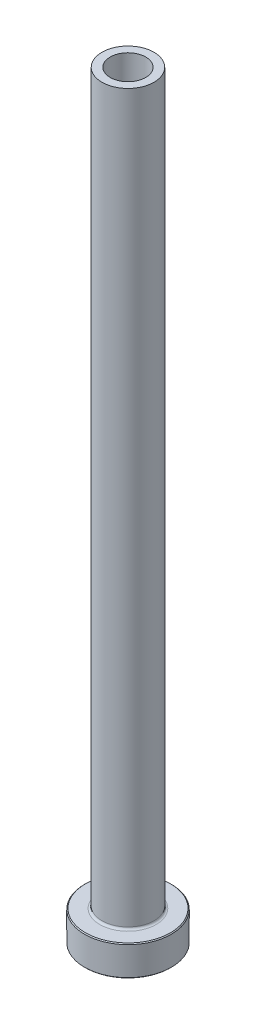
ISO-10303-21;
HEADER;
FILE_DESCRIPTION(('STEP AP214'),'2;1');
FILE_NAME('part.step','',(''),(''),'','','');
FILE_SCHEMA(('AUTOMOTIVE_DESIGN { 1 0 10303 214 1 1 1 1 }'));
ENDSEC;
DATA;
#1=APPLICATION_CONTEXT('core data for automotive mechanical design processes');
#2=APPLICATION_PROTOCOL_DEFINITION('international standard','automotive_design',2000,#1);
#3=PRODUCT_CONTEXT('',#1,'mechanical');
#4=PRODUCT('Part','Part','',(#3));
#5=PRODUCT_RELATED_PRODUCT_CATEGORY('part','',(#4));
#6=PRODUCT_DEFINITION_FORMATION('','',#4);
#7=PRODUCT_DEFINITION_CONTEXT('part definition',#1,'design');
#8=PRODUCT_DEFINITION('design','',#6,#7);
#9=PRODUCT_DEFINITION_SHAPE('','',#8);
#10=(LENGTH_UNIT() NAMED_UNIT(*) SI_UNIT(.MILLI.,.METRE.));
#11=(NAMED_UNIT(*) PLANE_ANGLE_UNIT() SI_UNIT($,.RADIAN.));
#12=(NAMED_UNIT(*) SI_UNIT($,.STERADIAN.) SOLID_ANGLE_UNIT());
#13=UNCERTAINTY_MEASURE_WITH_UNIT(LENGTH_MEASURE(1.E-05),#10,'distance_accuracy_value','');
#14=(GEOMETRIC_REPRESENTATION_CONTEXT(3) GLOBAL_UNCERTAINTY_ASSIGNED_CONTEXT((#13)) GLOBAL_UNIT_ASSIGNED_CONTEXT((#10,
#11,#12)) REPRESENTATION_CONTEXT('',''));
#15=CARTESIAN_POINT('',(0.,0.,0.));
#16=DIRECTION('',(0.,0.,1.));
#17=DIRECTION('',(1.,0.,0.));
#18=AXIS2_PLACEMENT_3D('',#15,#16,#17);
#19=CARTESIAN_POINT('',(0.,92.1876809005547,0.));
#20=DIRECTION('',(0.,1.,0.));
#21=DIRECTION('',(0.,0.,1.));
#22=AXIS2_PLACEMENT_3D('',#19,#20,#21);
#23=CYLINDRICAL_SURFACE('',#22,4.1);
#24=CARTESIAN_POINT('',(0.,175.,0.));
#25=DIRECTION('',(0.,1.,0.));
#26=DIRECTION('',(0.,0.,1.));
#27=AXIS2_PLACEMENT_3D('',#24,#25,#26);
#28=CIRCLE('',#27,4.1);
#29=CARTESIAN_POINT('',(0.,175.,4.1));
#30=VERTEX_POINT('',#29);
#31=EDGE_CURVE('E62',#30,#30,#28,.T.);
#32=ORIENTED_EDGE('',*,*,#31,.T.);
#33=EDGE_LOOP('',(#32));
#34=FACE_BOUND('',#33,.T.);
#35=CARTESIAN_POINT('',(0.,130.,0.));
#36=DIRECTION('',(0.,1.,0.));
#37=DIRECTION('',(0.,0.,1.));
#38=AXIS2_PLACEMENT_3D('',#35,#36,#37);
#39=CIRCLE('',#38,4.1);
#40=CARTESIAN_POINT('',(0.,130.,4.1));
#41=VERTEX_POINT('',#40);
#42=EDGE_CURVE('E71',#41,#41,#39,.T.);
#43=ORIENTED_EDGE('',*,*,#42,.F.);
#44=EDGE_LOOP('',(#43));
#45=FACE_BOUND('',#44,.T.);
#46=ADVANCED_FACE('F30',(#34,#45),#23,.F.);
#47=CARTESIAN_POINT('',(-4.1,175.,0.));
#48=DIRECTION('',(0.,1.,0.));
#49=DIRECTION('',(0.,0.,1.));
#50=AXIS2_PLACEMENT_3D('',#47,#48,#49);
#51=PLANE('',#50);
#52=CARTESIAN_POINT('',(0.,175.,0.));
#53=DIRECTION('',(0.,1.,0.));
#54=DIRECTION('',(0.,0.,1.));
#55=AXIS2_PLACEMENT_3D('',#52,#53,#54);
#56=CIRCLE('',#55,6.00000000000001);
#57=CARTESIAN_POINT('',(0.,175.,6.00000000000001));
#58=VERTEX_POINT('',#57);
#59=EDGE_CURVE('E65',#58,#58,#56,.T.);
#60=ORIENTED_EDGE('',*,*,#59,.T.);
#61=EDGE_LOOP('',(#60));
#62=FACE_BOUND('',#61,.T.);
#63=ORIENTED_EDGE('',*,*,#31,.F.);
#64=EDGE_LOOP('',(#63));
#65=FACE_BOUND('',#64,.T.);
#66=ADVANCED_FACE('F79',(#62,#65),#51,.T.);
#67=CARTESIAN_POINT('',(0.,92.1876809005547,0.));
#68=DIRECTION('',(0.,1.,0.));
#69=DIRECTION('',(0.,0.,1.));
#70=AXIS2_PLACEMENT_3D('',#67,#68,#69);
#71=CYLINDRICAL_SURFACE('',#70,6.);
#72=CARTESIAN_POINT('',(0.,7.50000000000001,0.));
#73=DIRECTION('',(0.,1.,0.));
#74=DIRECTION('',(0.,0.,1.));
#75=AXIS2_PLACEMENT_3D('',#72,#73,#74);
#76=CIRCLE('',#75,6.);
#77=CARTESIAN_POINT('',(0.,7.50000000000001,6.));
#78=VERTEX_POINT('',#77);
#79=EDGE_CURVE('E59',#78,#78,#76,.T.);
#80=ORIENTED_EDGE('',*,*,#79,.T.);
#81=EDGE_LOOP('',(#80));
#82=FACE_BOUND('',#81,.T.);
#83=ORIENTED_EDGE('',*,*,#59,.F.);
#84=EDGE_LOOP('',(#83));
#85=FACE_BOUND('',#84,.T.);
#86=ADVANCED_FACE('F85',(#82,#85),#71,.T.);
#87=CARTESIAN_POINT('',(-5.99999999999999,7.,0.));
#88=DIRECTION('',(0.,1.,0.));
#89=DIRECTION('',(0.,0.,1.));
#90=AXIS2_PLACEMENT_3D('',#87,#88,#89);
#91=PLANE('',#90);
#92=CARTESIAN_POINT('',(0.,7.,0.));
#93=DIRECTION('',(0.,1.,0.));
#94=DIRECTION('',(0.,0.,1.));
#95=AXIS2_PLACEMENT_3D('',#92,#93,#94);
#96=CIRCLE('',#95,9.79999999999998);
#97=CARTESIAN_POINT('',(0.,7.,9.79999999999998));
#98=VERTEX_POINT('',#97);
#99=EDGE_CURVE('E53',#98,#98,#96,.T.);
#100=ORIENTED_EDGE('',*,*,#99,.T.);
#101=EDGE_LOOP('',(#100));
#102=FACE_BOUND('',#101,.T.);
#103=CARTESIAN_POINT('',(0.,7.,0.));
#104=DIRECTION('',(0.,1.,0.));
#105=DIRECTION('',(0.,0.,1.));
#106=AXIS2_PLACEMENT_3D('',#103,#104,#105);
#107=CIRCLE('',#106,6.5);
#108=CARTESIAN_POINT('',(0.,7.,6.5));
#109=VERTEX_POINT('',#108);
#110=EDGE_CURVE('E56',#109,#109,#107,.F.);
#111=ORIENTED_EDGE('',*,*,#110,.T.);
#112=EDGE_LOOP('',(#111));
#113=FACE_BOUND('',#112,.T.);
#114=ADVANCED_FACE('F111',(#102,#113),#91,.T.);
#115=CARTESIAN_POINT('',(0.,92.1876809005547,0.));
#116=DIRECTION('',(0.,1.,0.));
#117=DIRECTION('',(0.,0.,1.));
#118=AXIS2_PLACEMENT_3D('',#115,#116,#117);
#119=CYLINDRICAL_SURFACE('',#118,9.99999999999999);
#120=CARTESIAN_POINT('',(0.,6.8,0.));
#121=DIRECTION('',(0.,1.,0.));
#122=DIRECTION('',(0.,0.,1.));
#123=AXIS2_PLACEMENT_3D('',#120,#121,#122);
#124=CIRCLE('',#123,9.99999999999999);
#125=CARTESIAN_POINT('',(0.,6.8,9.99999999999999));
#126=VERTEX_POINT('',#125);
#127=EDGE_CURVE('E45',#126,#126,#124,.F.);
#128=ORIENTED_EDGE('',*,*,#127,.T.);
#129=EDGE_LOOP('',(#128));
#130=FACE_BOUND('',#129,.T.);
#131=CARTESIAN_POINT('',(0.,0.200000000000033,0.));
#132=DIRECTION('',(0.,-1.,0.));
#133=DIRECTION('',(0.,0.,-1.));
#134=AXIS2_PLACEMENT_3D('',#131,#132,#133);
#135=CIRCLE('',#134,9.99999999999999);
#136=CARTESIAN_POINT('',(0.,0.200000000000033,-9.99999999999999));
#137=VERTEX_POINT('',#136);
#138=EDGE_CURVE('E50',#137,#137,#135,.F.);
#139=ORIENTED_EDGE('',*,*,#138,.T.);
#140=EDGE_LOOP('',(#139));
#141=FACE_BOUND('',#140,.T.);
#142=ADVANCED_FACE('F108',(#130,#141),#119,.T.);
#143=CARTESIAN_POINT('',(-9.99999999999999,0.,0.));
#144=DIRECTION('',(0.,-1.,0.));
#145=DIRECTION('',(0.,0.,-1.));
#146=AXIS2_PLACEMENT_3D('',#143,#144,#145);
#147=PLANE('',#146);
#148=CARTESIAN_POINT('',(0.,0.,0.));
#149=DIRECTION('',(0.,-1.,0.));
#150=DIRECTION('',(0.,0.,-1.));
#151=AXIS2_PLACEMENT_3D('',#148,#149,#150);
#152=CIRCLE('',#151,4.85000000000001);
#153=CARTESIAN_POINT('',(0.,0.,-4.85000000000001));
#154=VERTEX_POINT('',#153);
#155=EDGE_CURVE('E37',#154,#154,#152,.F.);
#156=ORIENTED_EDGE('',*,*,#155,.T.);
#157=EDGE_LOOP('',(#156));
#158=FACE_BOUND('',#157,.T.);
#159=CARTESIAN_POINT('',(0.,0.,0.));
#160=DIRECTION('',(0.,-1.,0.));
#161=DIRECTION('',(0.,0.,-1.));
#162=AXIS2_PLACEMENT_3D('',#159,#160,#161);
#163=CIRCLE('',#162,9.79999999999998);
#164=CARTESIAN_POINT('',(0.,0.,-9.79999999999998));
#165=VERTEX_POINT('',#164);
#166=EDGE_CURVE('E41',#165,#165,#163,.T.);
#167=ORIENTED_EDGE('',*,*,#166,.T.);
#168=EDGE_LOOP('',(#167));
#169=FACE_BOUND('',#168,.T.);
#170=ADVANCED_FACE('F110',(#158,#169),#147,.T.);
#171=CARTESIAN_POINT('',(0.,92.1876809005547,0.));
#172=DIRECTION('',(0.,1.,0.));
#173=DIRECTION('',(0.,0.,1.));
#174=AXIS2_PLACEMENT_3D('',#171,#172,#173);
#175=CYLINDRICAL_SURFACE('',#174,4.35);
#176=CARTESIAN_POINT('',(0.,0.5,0.));
#177=DIRECTION('',(0.,-1.,0.));
#178=DIRECTION('',(0.,0.,-1.));
#179=AXIS2_PLACEMENT_3D('',#176,#177,#178);
#180=CIRCLE('',#179,4.35);
#181=CARTESIAN_POINT('',(0.,0.5,-4.35));
#182=VERTEX_POINT('',#181);
#183=EDGE_CURVE('E10',#182,#182,#180,.T.);
#184=ORIENTED_EDGE('',*,*,#183,.T.);
#185=EDGE_LOOP('',(#184));
#186=FACE_BOUND('',#185,.T.);
#187=CARTESIAN_POINT('',(0.,118.,0.));
#188=DIRECTION('',(0.,1.,0.));
#189=DIRECTION('',(0.,0.,1.));
#190=AXIS2_PLACEMENT_3D('',#187,#188,#189);
#191=CIRCLE('',#190,4.35);
#192=CARTESIAN_POINT('',(0.,118.,4.35));
#193=VERTEX_POINT('',#192);
#194=EDGE_CURVE('E68',#193,#193,#191,.T.);
#195=ORIENTED_EDGE('',*,*,#194,.T.);
#196=EDGE_LOOP('',(#195));
#197=FACE_BOUND('',#196,.T.);
#198=ADVANCED_FACE('F118',(#186,#197),#175,.F.);
#199=CARTESIAN_POINT('',(0.,118.,0.));
#200=DIRECTION('',(0.,-1.,0.));
#201=DIRECTION('',(0.,0.,-1.));
#202=AXIS2_PLACEMENT_3D('',#199,#200,#201);
#203=CONICAL_SURFACE('',#202,4.35,0.0208303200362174);
#204=ORIENTED_EDGE('',*,*,#42,.T.);
#205=EDGE_LOOP('',(#204));
#206=FACE_BOUND('',#205,.T.);
#207=ORIENTED_EDGE('',*,*,#194,.F.);
#208=EDGE_LOOP('',(#207));
#209=FACE_BOUND('',#208,.T.);
#210=ADVANCED_FACE('F75',(#206,#209),#203,.F.);
#211=CARTESIAN_POINT('',(0.,7.50000000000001,0.));
#212=DIRECTION('',(0.,1.,0.));
#213=DIRECTION('',(0.,0.,1.));
#214=AXIS2_PLACEMENT_3D('',#211,#212,#213);
#215=TOROIDAL_SURFACE('',#214,6.5,0.5);
#216=ORIENTED_EDGE('',*,*,#110,.F.);
#217=EDGE_LOOP('',(#216));
#218=FACE_BOUND('',#217,.T.);
#219=ORIENTED_EDGE('',*,*,#79,.F.);
#220=EDGE_LOOP('',(#219));
#221=FACE_BOUND('',#220,.T.);
#222=ADVANCED_FACE('F90',(#218,#221),#215,.F.);
#223=CARTESIAN_POINT('',(0.,7.00000000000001,0.));
#224=DIRECTION('',(0.,-1.,0.));
#225=DIRECTION('',(0.,0.,-1.));
#226=AXIS2_PLACEMENT_3D('',#223,#224,#225);
#227=CONICAL_SURFACE('',#226,9.79999999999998,0.785398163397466);
#228=ORIENTED_EDGE('',*,*,#127,.F.);
#229=EDGE_LOOP('',(#228));
#230=FACE_BOUND('',#229,.T.);
#231=ORIENTED_EDGE('',*,*,#99,.F.);
#232=EDGE_LOOP('',(#231));
#233=FACE_BOUND('',#232,.T.);
#234=ADVANCED_FACE('F93',(#230,#233),#227,.T.);
#235=CARTESIAN_POINT('',(0.,0.200000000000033,0.));
#236=DIRECTION('',(0.,1.,0.));
#237=DIRECTION('',(0.,0.,1.));
#238=AXIS2_PLACEMENT_3D('',#235,#236,#237);
#239=CONICAL_SURFACE('',#238,9.99999999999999,0.785398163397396);
#240=ORIENTED_EDGE('',*,*,#166,.F.);
#241=EDGE_LOOP('',(#240));
#242=FACE_BOUND('',#241,.T.);
#243=ORIENTED_EDGE('',*,*,#138,.F.);
#244=EDGE_LOOP('',(#243));
#245=FACE_BOUND('',#244,.T.);
#246=ADVANCED_FACE('F96',(#242,#245),#239,.T.);
#247=CARTESIAN_POINT('',(0.,0.,0.));
#248=DIRECTION('',(0.,-1.,0.));
#249=DIRECTION('',(0.,0.,-1.));
#250=AXIS2_PLACEMENT_3D('',#247,#248,#249);
#251=CONICAL_SURFACE('',#250,4.85000000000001,0.785398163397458);
#252=ORIENTED_EDGE('',*,*,#183,.F.);
#253=EDGE_LOOP('',(#252));
#254=FACE_BOUND('',#253,.T.);
#255=ORIENTED_EDGE('',*,*,#155,.F.);
#256=EDGE_LOOP('',(#255));
#257=FACE_BOUND('',#256,.T.);
#258=ADVANCED_FACE('F32',(#254,#257),#251,.F.);
#259=CLOSED_SHELL('',(#46,#66,#86,#114,#142,#170,#198,#210,#222,#234,#246,#258));
#260=MANIFOLD_SOLID_BREP('B2',#259);
#261=ADVANCED_BREP_SHAPE_REPRESENTATION('',(#18,#260),#14);
#262=SHAPE_DEFINITION_REPRESENTATION(#9,#261);
ENDSEC;
END-ISO-10303-21;
